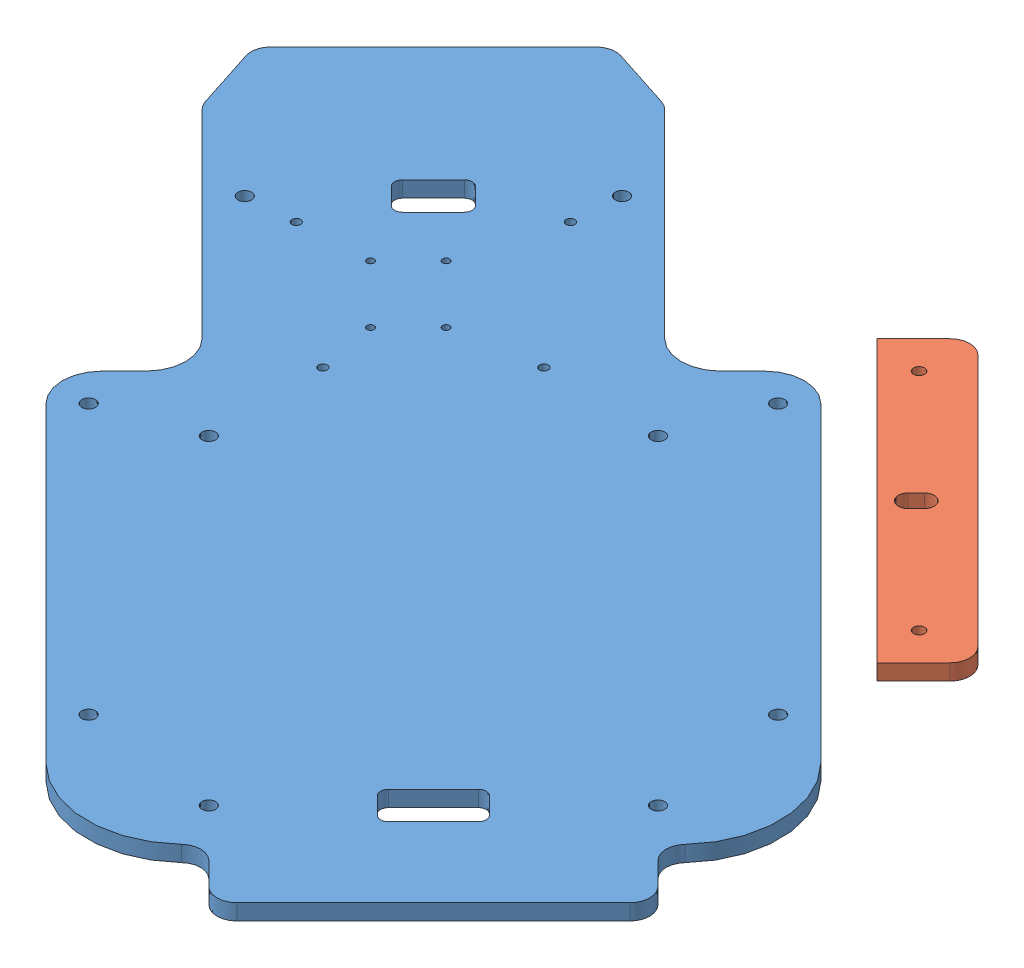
SolidWorks assembly TopCutPattern.SLDASM, configuration Default (file format 12000). Lengths in mm.
Overall size (361.01 5.08 361.01).
2 component instances, 2 part files, 8 mates.
Components (placement in the parent):
- TopPlate-1: TopPlate.SLDPRT [Default] at (251.5514 0 251.343) x (0.707107 0 -0.707107) z (0.707107 0 0.707107) size (175.26 5.08 335.28)
- MonitorSupport-1: MonitorSupport.SLDPRT [Default] at (227.3047 0 85.2082) x (0.707107 0 0.707107) z (-0.707107 0 0.707107) size (127 5.08 22.86)
Mates (geometry in assembly coordinates):
- Distance1: distance = 12.7 mm anti-aligned: plane of MonitorSupport-1 through (227.3047 5.08 85.2082) normal (-0.707107 0 0.707107); plane of TopPlate-1 through (182.4034 5.08 58.2675) normal (0.707107 0 -0.707107)
- Coincident2: coincident aligned: plane of TopPlate-1 through (251.5514 5.08 251.343) normal (0 1 0); plane of MonitorSupport-1 through (227.3047 5.08 85.2082) normal (0 1 0)
- Distance2: distance = 114.3 mm aligned: plane of MonitorSupport-1 through (182.4034 5.08 40.3069) normal (-0.707107 0 -0.707107); plane of TopPlate-1 through (1.9003 0 59.1655) normal (-0.707107 0 -0.707107)
- Parallel1: parallel aligned: line of TopPlate-1 through (67.4561 5.08 191.1752) axis (0.707107 0 0.707107)
- Coincident7: coincident: plane of TopPlate-1 through (251.5514 0 251.343) normal (0 -1 0)
- Distance3: distance = 43.18 mm: line of TopPlate-1 through (56.6262 0 4.4395) axis (-0.707107 0 0.707107)
- Distance4: distance = 87.63 mm: line of assembly; line of assembly; line of TopPlate-1 through (67.4561 5.08 191.1752) axis (0.707107 0 0.707107)
- Parallel4: parallel: plane of TopPlate-1 through (251.5514 5.08 251.343) normal (0 1 0)
